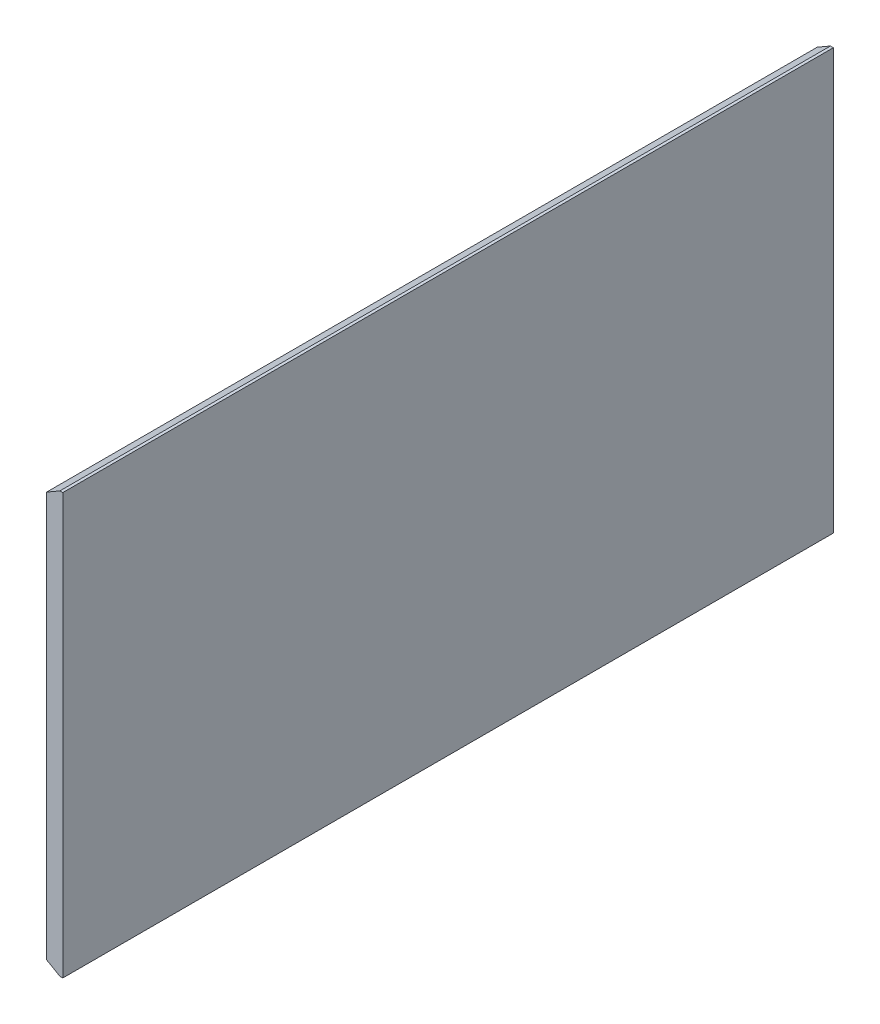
from build123d import *

# Parameters (mm, degrees)
SKETCH1_W           = 1158
SKETCH1_H           = 2122.7
BOSS_EXTRUDE1_DEPTH = 22.225
CHAMFER1_SIZE       = 21
CHAMFER1_SIZE2      = 36.373066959


with BuildPart() as part:
    # Sketch1 → Boss-Extrude1 (new, symmetric)
    with BuildSketch(Plane.YZ):
        Rectangle(SKETCH1_W, SKETCH1_H)
    extrude(amount=BOSS_EXTRUDE1_DEPTH, both=True)

    # Chamfer1
    chamfer1_edges = [part.edges().sort_by_distance(p)[0] for p in [
        (-22.225, -579, 0),
        (-22.225, 579, 0),
    ]]
    chamfer1_side = [part.faces().sort_by_distance(p)[0] for p in [
        (-22.225, 0, 0),
    ]]
    chamfer(chamfer1_edges, length=CHAMFER1_SIZE, length2=CHAMFER1_SIZE2, reference=chamfer1_side[0])


solid = part.part
